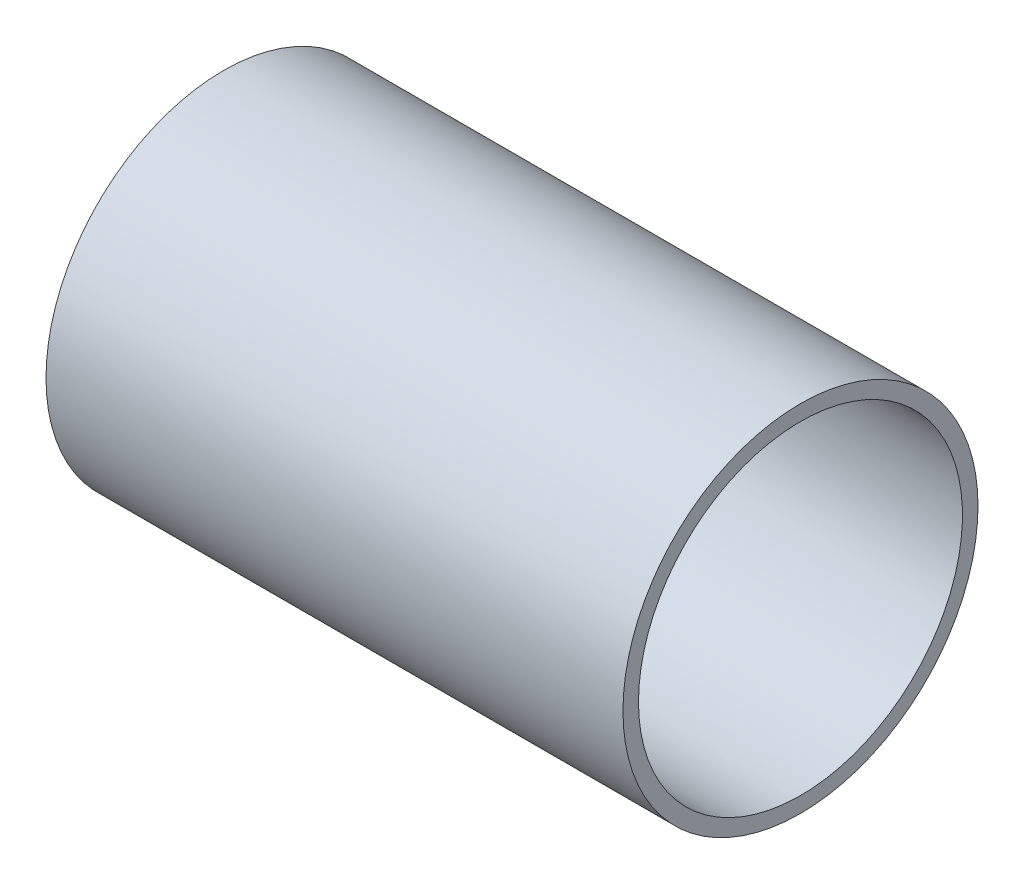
ISO-10303-21;
HEADER;
FILE_DESCRIPTION(('STEP AP214'),'2;1');
FILE_NAME('part.step','',(''),(''),'','','');
FILE_SCHEMA(('AUTOMOTIVE_DESIGN { 1 0 10303 214 1 1 1 1 }'));
ENDSEC;
DATA;
#1=APPLICATION_CONTEXT('core data for automotive mechanical design processes');
#2=APPLICATION_PROTOCOL_DEFINITION('international standard','automotive_design',2000,#1);
#3=PRODUCT_CONTEXT('',#1,'mechanical');
#4=PRODUCT('Part','Part','',(#3));
#5=PRODUCT_RELATED_PRODUCT_CATEGORY('part','',(#4));
#6=PRODUCT_DEFINITION_FORMATION('','',#4);
#7=PRODUCT_DEFINITION_CONTEXT('part definition',#1,'design');
#8=PRODUCT_DEFINITION('design','',#6,#7);
#9=PRODUCT_DEFINITION_SHAPE('','',#8);
#10=(LENGTH_UNIT() NAMED_UNIT(*) SI_UNIT(.MILLI.,.METRE.));
#11=(NAMED_UNIT(*) PLANE_ANGLE_UNIT() SI_UNIT($,.RADIAN.));
#12=(NAMED_UNIT(*) SI_UNIT($,.STERADIAN.) SOLID_ANGLE_UNIT());
#13=UNCERTAINTY_MEASURE_WITH_UNIT(LENGTH_MEASURE(1.E-05),#10,'distance_accuracy_value','');
#14=(GEOMETRIC_REPRESENTATION_CONTEXT(3) GLOBAL_UNCERTAINTY_ASSIGNED_CONTEXT((#13)) GLOBAL_UNIT_ASSIGNED_CONTEXT((#10,
#11,#12)) REPRESENTATION_CONTEXT('',''));
#15=CARTESIAN_POINT('',(0.,0.,0.));
#16=DIRECTION('',(0.,0.,1.));
#17=DIRECTION('',(1.,0.,0.));
#18=AXIS2_PLACEMENT_3D('',#15,#16,#17);
#19=CARTESIAN_POINT('',(0.,0.,0.));
#20=DIRECTION('',(1.,0.,0.));
#21=DIRECTION('',(0.,0.,-1.));
#22=AXIS2_PLACEMENT_3D('',#19,#20,#21);
#23=PLANE('',#22);
#24=CARTESIAN_POINT('',(0.,3.65,0.));
#25=DIRECTION('',(-1.,0.,0.));
#26=DIRECTION('',(0.,0.,1.));
#27=AXIS2_PLACEMENT_3D('',#24,#25,#26);
#28=CIRCLE('',#27,3.65);
#29=CARTESIAN_POINT('',(0.,3.65,3.65));
#30=VERTEX_POINT('',#29);
#31=EDGE_CURVE('E51',#30,#30,#28,.T.);
#32=ORIENTED_EDGE('',*,*,#31,.T.);
#33=EDGE_LOOP('',(#32));
#34=FACE_BOUND('',#33,.T.);
#35=CARTESIAN_POINT('',(0.,3.65,0.));
#36=DIRECTION('',(-1.,0.,0.));
#37=DIRECTION('',(0.,0.,1.));
#38=AXIS2_PLACEMENT_3D('',#35,#36,#37);
#39=CIRCLE('',#38,4.);
#40=CARTESIAN_POINT('',(0.,3.65,4.));
#41=VERTEX_POINT('',#40);
#42=EDGE_CURVE('E10',#41,#41,#39,.T.);
#43=ORIENTED_EDGE('',*,*,#42,.F.);
#44=EDGE_LOOP('',(#43));
#45=FACE_BOUND('',#44,.T.);
#46=ADVANCED_FACE('F37',(#34,#45),#23,.T.);
#47=CARTESIAN_POINT('',(-22.,3.65,0.));
#48=DIRECTION('',(-1.,0.,0.));
#49=DIRECTION('',(0.,0.,1.));
#50=AXIS2_PLACEMENT_3D('',#47,#48,#49);
#51=CYLINDRICAL_SURFACE('',#50,4.);
#52=ORIENTED_EDGE('',*,*,#42,.T.);
#53=EDGE_LOOP('',(#52));
#54=FACE_BOUND('',#53,.T.);
#55=CARTESIAN_POINT('',(-13.,3.65,0.));
#56=DIRECTION('',(-1.,0.,0.));
#57=DIRECTION('',(0.,0.,1.));
#58=AXIS2_PLACEMENT_3D('',#55,#56,#57);
#59=CIRCLE('',#58,4.);
#60=CARTESIAN_POINT('',(-13.,3.65,4.));
#61=VERTEX_POINT('',#60);
#62=EDGE_CURVE('E43',#61,#61,#59,.T.);
#63=ORIENTED_EDGE('',*,*,#62,.F.);
#64=EDGE_LOOP('',(#63));
#65=FACE_BOUND('',#64,.T.);
#66=ADVANCED_FACE('F67',(#54,#65),#51,.T.);
#67=CARTESIAN_POINT('',(-13.,0.,0.));
#68=DIRECTION('',(-1.,0.,0.));
#69=DIRECTION('',(0.,0.,1.));
#70=AXIS2_PLACEMENT_3D('',#67,#68,#69);
#71=PLANE('',#70);
#72=ORIENTED_EDGE('',*,*,#62,.T.);
#73=EDGE_LOOP('',(#72));
#74=FACE_BOUND('',#73,.T.);
#75=CARTESIAN_POINT('',(-13.,3.65,0.));
#76=DIRECTION('',(-1.,0.,0.));
#77=DIRECTION('',(0.,0.,1.));
#78=AXIS2_PLACEMENT_3D('',#75,#76,#77);
#79=CIRCLE('',#78,3.65);
#80=CARTESIAN_POINT('',(-13.,3.65,3.65));
#81=VERTEX_POINT('',#80);
#82=EDGE_CURVE('E47',#81,#81,#79,.T.);
#83=ORIENTED_EDGE('',*,*,#82,.F.);
#84=EDGE_LOOP('',(#83));
#85=FACE_BOUND('',#84,.T.);
#86=ADVANCED_FACE('F61',(#74,#85),#71,.T.);
#87=CARTESIAN_POINT('',(-22.,3.65,0.));
#88=DIRECTION('',(-1.,0.,0.));
#89=DIRECTION('',(0.,0.,1.));
#90=AXIS2_PLACEMENT_3D('',#87,#88,#89);
#91=CYLINDRICAL_SURFACE('',#90,3.65);
#92=ORIENTED_EDGE('',*,*,#82,.T.);
#93=EDGE_LOOP('',(#92));
#94=FACE_BOUND('',#93,.T.);
#95=ORIENTED_EDGE('',*,*,#31,.F.);
#96=EDGE_LOOP('',(#95));
#97=FACE_BOUND('',#96,.T.);
#98=ADVANCED_FACE('F59',(#94,#97),#91,.F.);
#99=CLOSED_SHELL('',(#46,#66,#86,#98));
#100=MANIFOLD_SOLID_BREP('B2',#99);
#101=ADVANCED_BREP_SHAPE_REPRESENTATION('',(#18,#100),#14);
#102=SHAPE_DEFINITION_REPRESENTATION(#9,#101);
ENDSEC;
END-ISO-10303-21;
